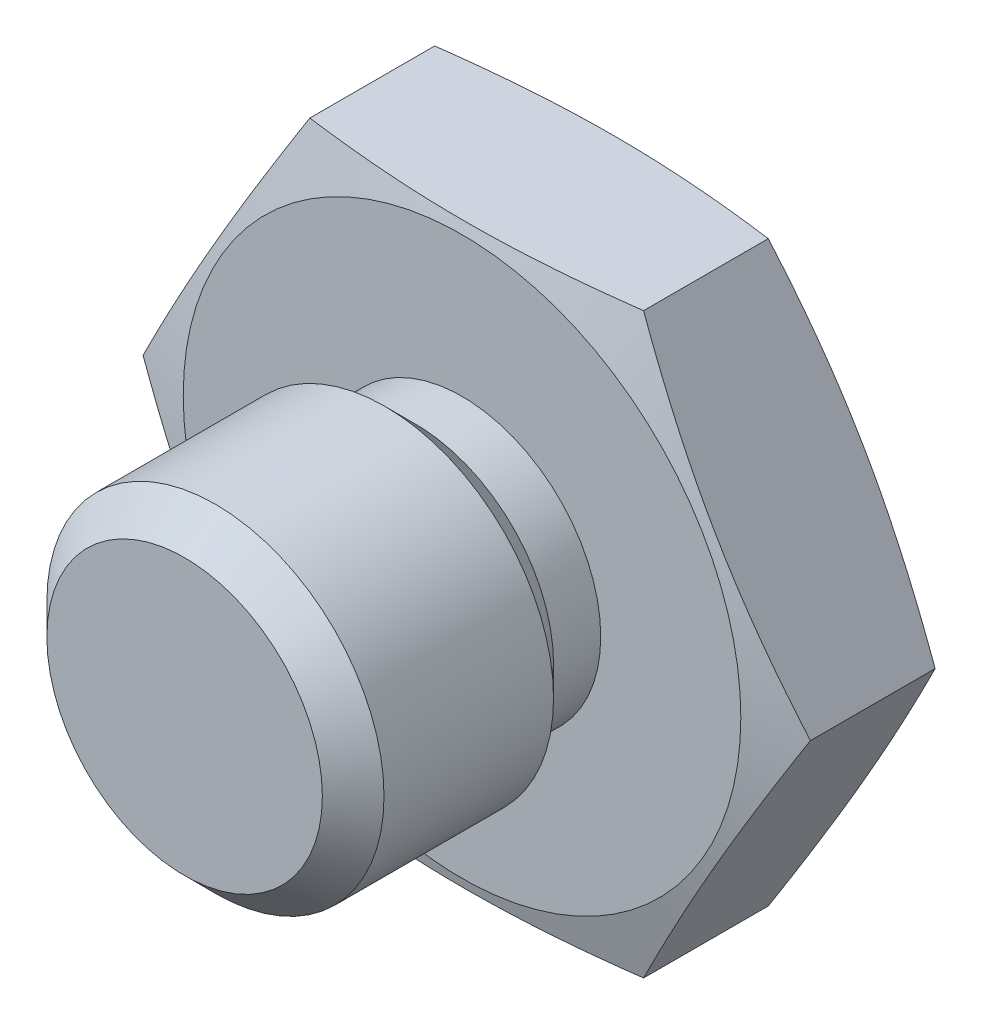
ISO-10303-21;
HEADER;
FILE_DESCRIPTION(('STEP AP214'),'2;1');
FILE_NAME('part.step','',(''),(''),'','','');
FILE_SCHEMA(('AUTOMOTIVE_DESIGN { 1 0 10303 214 1 1 1 1 }'));
ENDSEC;
DATA;
#1=APPLICATION_CONTEXT('core data for automotive mechanical design processes');
#2=APPLICATION_PROTOCOL_DEFINITION('international standard','automotive_design',2000,#1);
#3=PRODUCT_CONTEXT('',#1,'mechanical');
#4=PRODUCT('Part','Part','',(#3));
#5=PRODUCT_RELATED_PRODUCT_CATEGORY('part','',(#4));
#6=PRODUCT_DEFINITION_FORMATION('','',#4);
#7=PRODUCT_DEFINITION_CONTEXT('part definition',#1,'design');
#8=PRODUCT_DEFINITION('design','',#6,#7);
#9=PRODUCT_DEFINITION_SHAPE('','',#8);
#10=(LENGTH_UNIT() NAMED_UNIT(*) SI_UNIT(.MILLI.,.METRE.));
#11=(NAMED_UNIT(*) PLANE_ANGLE_UNIT() SI_UNIT($,.RADIAN.));
#12=(NAMED_UNIT(*) SI_UNIT($,.STERADIAN.) SOLID_ANGLE_UNIT());
#13=UNCERTAINTY_MEASURE_WITH_UNIT(LENGTH_MEASURE(1.E-05),#10,'distance_accuracy_value','');
#14=(GEOMETRIC_REPRESENTATION_CONTEXT(3) GLOBAL_UNCERTAINTY_ASSIGNED_CONTEXT((#13)) GLOBAL_UNIT_ASSIGNED_CONTEXT((#10,
#11,#12)) REPRESENTATION_CONTEXT('',''));
#15=CARTESIAN_POINT('',(0.,0.,0.));
#16=DIRECTION('',(0.,0.,1.));
#17=DIRECTION('',(1.,0.,0.));
#18=AXIS2_PLACEMENT_3D('',#15,#16,#17);
#19=CARTESIAN_POINT('',(0.,0.,9.144));
#20=DIRECTION('',(0.,0.,-1.));
#21=DIRECTION('',(-1.,0.,0.));
#22=AXIS2_PLACEMENT_3D('',#19,#20,#21);
#23=CYLINDRICAL_SURFACE('',#22,5.55625);
#24=CARTESIAN_POINT('',(0.,0.,8.12799999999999));
#25=DIRECTION('',(0.,0.,1.));
#26=DIRECTION('',(1.,0.,0.));
#27=AXIS2_PLACEMENT_3D('',#24,#25,#26);
#28=CIRCLE('',#27,5.55625);
#29=CARTESIAN_POINT('',(5.55625,0.,8.12799999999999));
#30=VERTEX_POINT('',#29);
#31=EDGE_CURVE('E11',#30,#30,#28,.F.);
#32=ORIENTED_EDGE('',*,*,#31,.T.);
#33=EDGE_LOOP('',(#32));
#34=FACE_BOUND('',#33,.T.);
#35=CARTESIAN_POINT('',(0.,0.,2.54));
#36=DIRECTION('',(0.,0.,-1.));
#37=DIRECTION('',(-1.,0.,0.));
#38=AXIS2_PLACEMENT_3D('',#35,#36,#37);
#39=CIRCLE('',#38,5.55625);
#40=CARTESIAN_POINT('',(-5.55625,0.,2.54));
#41=VERTEX_POINT('',#40);
#42=EDGE_CURVE('E225',#41,#41,#39,.T.);
#43=ORIENTED_EDGE('',*,*,#42,.F.);
#44=EDGE_LOOP('',(#43));
#45=FACE_BOUND('',#44,.T.);
#46=ADVANCED_FACE('F38',(#34,#45),#23,.T.);
#47=CARTESIAN_POINT('',(0.,0.,9.144));
#48=DIRECTION('',(0.,0.,1.));
#49=DIRECTION('',(1.,0.,0.));
#50=AXIS2_PLACEMENT_3D('',#47,#48,#49);
#51=PLANE('',#50);
#52=CARTESIAN_POINT('',(0.,0.,9.144));
#53=DIRECTION('',(0.,0.,1.));
#54=DIRECTION('',(1.,0.,0.));
#55=AXIS2_PLACEMENT_3D('',#52,#53,#54);
#56=CIRCLE('',#55,4.54024999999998);
#57=CARTESIAN_POINT('',(4.54024999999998,0.,9.144));
#58=VERTEX_POINT('',#57);
#59=EDGE_CURVE('E45',#58,#58,#56,.T.);
#60=ORIENTED_EDGE('',*,*,#59,.T.);
#61=EDGE_LOOP('',(#60));
#62=FACE_BOUND('',#61,.T.);
#63=ADVANCED_FACE('F183',(#62),#51,.T.);
#64=CARTESIAN_POINT('',(0.,0.,0.));
#65=DIRECTION('',(0.,0.,-1.));
#66=DIRECTION('',(-1.,0.,0.));
#67=AXIS2_PLACEMENT_3D('',#64,#65,#66);
#68=CYLINDRICAL_SURFACE('',#67,4.572);
#69=CARTESIAN_POINT('',(0.,0.,1.55575));
#70=DIRECTION('',(0.,0.,-1.));
#71=DIRECTION('',(-1.,0.,0.));
#72=AXIS2_PLACEMENT_3D('',#69,#70,#71);
#73=CIRCLE('',#72,4.572);
#74=CARTESIAN_POINT('',(-4.572,0.,1.55575));
#75=VERTEX_POINT('',#74);
#76=EDGE_CURVE('E226',#75,#75,#73,.T.);
#77=ORIENTED_EDGE('',*,*,#76,.T.);
#78=EDGE_LOOP('',(#77));
#79=FACE_BOUND('',#78,.T.);
#80=CARTESIAN_POINT('',(0.,0.,0.));
#81=DIRECTION('',(0.,0.,-1.));
#82=DIRECTION('',(-1.,0.,0.));
#83=AXIS2_PLACEMENT_3D('',#80,#81,#82);
#84=CIRCLE('',#83,4.572);
#85=CARTESIAN_POINT('',(-4.572,0.,0.));
#86=VERTEX_POINT('',#85);
#87=EDGE_CURVE('E229',#86,#86,#84,.T.);
#88=ORIENTED_EDGE('',*,*,#87,.F.);
#89=EDGE_LOOP('',(#88));
#90=FACE_BOUND('',#89,.T.);
#91=ADVANCED_FACE('F148',(#79,#90),#68,.T.);
#92=CARTESIAN_POINT('',(0.,0.,1.55575));
#93=DIRECTION('',(0.,0.,1.));
#94=DIRECTION('',(1.,0.,0.));
#95=AXIS2_PLACEMENT_3D('',#92,#93,#94);
#96=CONICAL_SURFACE('',#95,4.572,0.785398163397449);
#97=ORIENTED_EDGE('',*,*,#42,.T.);
#98=EDGE_LOOP('',(#97));
#99=FACE_BOUND('',#98,.T.);
#100=ORIENTED_EDGE('',*,*,#76,.F.);
#101=EDGE_LOOP('',(#100));
#102=FACE_BOUND('',#101,.T.);
#103=ADVANCED_FACE('F207',(#99,#102),#96,.T.);
#104=CARTESIAN_POINT('',(-10.9985226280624,0.,0.));
#105=DIRECTION('',(0.,0.,1.));
#106=DIRECTION('',(1.,0.,0.));
#107=AXIS2_PLACEMENT_3D('',#104,#105,#106);
#108=PLANE('',#107);
#109=CARTESIAN_POINT('',(0.,0.,0.));
#110=DIRECTION('',(0.,0.,-1.));
#111=DIRECTION('',(-1.,0.,0.));
#112=AXIS2_PLACEMENT_3D('',#109,#110,#111);
#113=CIRCLE('',#112,9.18959094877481);
#114=CARTESIAN_POINT('',(-9.18959094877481,0.,0.));
#115=VERTEX_POINT('',#114);
#116=EDGE_CURVE('E135',#115,#115,#113,.T.);
#117=ORIENTED_EDGE('',*,*,#116,.F.);
#118=EDGE_LOOP('',(#117));
#119=FACE_BOUND('',#118,.T.);
#120=ORIENTED_EDGE('',*,*,#87,.T.);
#121=EDGE_LOOP('',(#120));
#122=FACE_BOUND('',#121,.T.);
#123=ADVANCED_FACE('F147',(#119,#122),#108,.T.);
#124=CARTESIAN_POINT('',(0.,0.,-2.54));
#125=DIRECTION('',(0.,0.,-1.));
#126=DIRECTION('',(-1.,0.,0.));
#127=AXIS2_PLACEMENT_3D('',#124,#125,#126);
#128=CONICAL_SURFACE('',#127,18.669,1.30899693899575);
#129=CARTESIAN_POINT('',(-5.49914584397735,-9.5252,-0.484732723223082));
#130=CARTESIAN_POINT('',(-5.7275259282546,-9.12963409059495,-0.423513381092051));
#131=CARTESIAN_POINT('',(-5.95632008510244,-8.73335098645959,-0.367936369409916));
#132=CARTESIAN_POINT('',(-6.41471638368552,-7.93938530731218,-0.270292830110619));
#133=CARTESIAN_POINT('',(-6.64431881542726,-7.54170222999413,-0.228231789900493));
#134=CARTESIAN_POINT('',(-7.10293961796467,-6.74734769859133,-0.160075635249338));
#135=CARTESIAN_POINT('',(-7.33195488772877,-6.35068161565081,-0.133899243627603));
#136=CARTESIAN_POINT('',(-7.7902774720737,-5.55684361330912,-0.098799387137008));
#137=CARTESIAN_POINT('',(-8.01958472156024,-5.15967180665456,-0.0898725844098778));
#138=CARTESIAN_POINT('',(-8.47819922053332,-4.36532819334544,-0.0898725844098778));
#139=CARTESIAN_POINT('',(-8.70750647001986,-3.96815638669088,-0.098799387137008));
#140=CARTESIAN_POINT('',(-9.16582905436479,-3.17431838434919,-0.133899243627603));
#141=CARTESIAN_POINT('',(-9.3948443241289,-2.77765230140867,-0.160075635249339));
#142=CARTESIAN_POINT('',(-9.8534651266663,-1.98329777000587,-0.228231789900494));
#143=CARTESIAN_POINT('',(-10.083067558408,-1.58561469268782,-0.27029283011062));
#144=CARTESIAN_POINT('',(-10.5414638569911,-0.791649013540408,-0.367936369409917));
#145=CARTESIAN_POINT('',(-10.770258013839,-0.395365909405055,-0.423513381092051));
#146=CARTESIAN_POINT('',(-10.9986380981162,0.000200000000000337,-0.484732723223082));
#147=B_SPLINE_CURVE_WITH_KNOTS('',3,(#129,#130,#131,#132,#133,#134,#135,#136,#137,#138,#139,
#140,#141,#142,#143,#144,#145,#146),.UNSPECIFIED.,.F.,.F.,(4,2,2,2,2,2,2,2,4),(0.,
1.38260595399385,2.7657725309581,4.14180081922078,5.51756281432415,6.89332480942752,
8.26935309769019,9.65251967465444,11.0351256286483),.UNSPECIFIED.);
#148=CARTESIAN_POINT('',(-5.49926131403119,-9.525,-0.484701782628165));
#149=VERTEX_POINT('',#148);
#150=CARTESIAN_POINT('',(-10.9985226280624,0.,-0.484701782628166));
#151=VERTEX_POINT('',#150);
#152=EDGE_CURVE('E110',#149,#151,#147,.T.);
#153=ORIENTED_EDGE('',*,*,#152,.F.);
#154=CARTESIAN_POINT('',(-14.6812478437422,-9.525,-2.2268796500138));
#155=CARTESIAN_POINT('',(-14.247613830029,-9.525,-2.12943108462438));
#156=CARTESIAN_POINT('',(-13.8137122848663,-9.525,-2.03315206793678));
#157=CARTESIAN_POINT('',(-12.945242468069,-9.525,-1.84356458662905));
#158=CARTESIAN_POINT('',(-12.5106741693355,-9.525,-1.75025624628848));
#159=CARTESIAN_POINT('',(-11.6403676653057,-9.525,-1.56716404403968));
#160=CARTESIAN_POINT('',(-11.2046287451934,-9.525,-1.47738356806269));
#161=CARTESIAN_POINT('',(-10.3322537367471,-9.525,-1.30229497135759));
#162=CARTESIAN_POINT('',(-9.89561765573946,-9.525,-1.21698681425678));
#163=CARTESIAN_POINT('',(-9.02470452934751,-9.525,-1.05255540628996));
#164=CARTESIAN_POINT('',(-8.59043565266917,-9.525,-0.973389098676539));
#165=CARTESIAN_POINT('',(-7.72070990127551,-9.525,-0.821820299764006));
#166=CARTESIAN_POINT('',(-7.28525302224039,-9.525,-0.749417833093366));
#167=CARTESIAN_POINT('',(-6.41306799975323,-9.525,-0.612982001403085));
#168=CARTESIAN_POINT('',(-5.97634000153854,-9.525,-0.548947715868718));
#169=CARTESIAN_POINT('',(-5.10149008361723,-9.525,-0.43110971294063));
#170=CARTESIAN_POINT('',(-4.66336816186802,-9.525,-0.377306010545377));
#171=CARTESIAN_POINT('',(-3.780738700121,-9.525,-0.281424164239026));
#172=CARTESIAN_POINT('',(-3.33621555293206,-9.525,-0.239487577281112));
#173=CARTESIAN_POINT('',(-2.44602311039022,-9.525,-0.17021398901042));
#174=CARTESIAN_POINT('',(-2.00035384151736,-9.525,-0.14287665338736));
#175=CARTESIAN_POINT('',(-1.10851776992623,-9.525,-0.104394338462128));
#176=CARTESIAN_POINT('',(-0.662351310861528,-9.525,-0.0932415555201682));
#177=CARTESIAN_POINT('',(0.230085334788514,-9.525,-0.0878175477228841));
#178=CARTESIAN_POINT('',(0.676355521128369,-9.525,-0.0935462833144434));
#179=CARTESIAN_POINT('',(1.56996421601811,-9.525,-0.121563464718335));
#180=CARTESIAN_POINT('',(2.01730082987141,-9.525,-0.143911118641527));
#181=CARTESIAN_POINT('',(2.91094001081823,-9.525,-0.203877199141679));
#182=CARTESIAN_POINT('',(3.35724255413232,-9.525,-0.241495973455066));
#183=CARTESIAN_POINT('',(4.24880449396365,-9.525,-0.330071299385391));
#184=CARTESIAN_POINT('',(4.69406298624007,-9.525,-0.381036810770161));
#185=CARTESIAN_POINT('',(5.58314220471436,-9.525,-0.494144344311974));
#186=CARTESIAN_POINT('',(6.026962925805,-9.525,-0.556286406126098));
#187=CARTESIAN_POINT('',(6.884403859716,-9.525,-0.685383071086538));
#188=CARTESIAN_POINT('',(7.29811162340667,-9.525,-0.751762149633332));
#189=CARTESIAN_POINT('',(8.12442684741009,-9.525,-0.891079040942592));
#190=CARTESIAN_POINT('',(8.53703427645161,-9.525,-0.964017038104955));
#191=CARTESIAN_POINT('',(9.36130559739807,-9.525,-1.11524942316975));
#192=CARTESIAN_POINT('',(9.77296938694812,-9.525,-1.19354436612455));
#193=CARTESIAN_POINT('',(10.5954357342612,-9.525,-1.35449853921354));
#194=CARTESIAN_POINT('',(11.0062383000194,-9.525,-1.437157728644));
#195=CARTESIAN_POINT('',(11.8272085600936,-9.525,-1.60606867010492));
#196=CARTESIAN_POINT('',(12.2373760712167,-9.525,-1.69232131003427));
#197=CARTESIAN_POINT('',(13.0570816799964,-9.525,-1.86777160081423));
#198=CARTESIAN_POINT('',(13.4666197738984,-9.525,-1.95696926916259));
#199=CARTESIAN_POINT('',(14.6943745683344,-9.525,-2.22818055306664));
#200=CARTESIAN_POINT('',(15.5117890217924,-9.525,-2.41382438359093));
#201=CARTESIAN_POINT('',(17.1372505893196,-9.525,-2.79004702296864));
#202=CARTESIAN_POINT('',(17.9453126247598,-9.525,-2.98056178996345));
#203=CARTESIAN_POINT('',(19.5603058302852,-9.525,-3.36638339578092));
#204=CARTESIAN_POINT('',(20.3672369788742,-9.525,-3.56169032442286));
#205=CARTESIAN_POINT('',(21.9792065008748,-9.525,-3.95559693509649));
#206=CARTESIAN_POINT('',(22.7842459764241,-9.525,-4.1541921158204));
#207=CARTESIAN_POINT('',(23.9912908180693,-9.525,-4.45409478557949));
#208=CARTESIAN_POINT('',(24.3935467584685,-9.525,-4.55439565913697));
#209=CARTESIAN_POINT('',(25.1979097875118,-9.525,-4.75559072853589));
#210=CARTESIAN_POINT('',(25.6000168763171,-9.525,-4.85648492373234));
#211=CARTESIAN_POINT('',(26.0020590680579,-9.525,-4.95763704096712));
#212=B_SPLINE_CURVE_WITH_KNOTS('',3,(#154,#155,#156,#157,#158,#159,#160,#161,#162,#163,#164,
#165,#166,#167,#168,#169,#170,#171,#172,#173,#174,#175,#176,#177,#178,#179,#180,#181,#182,#183,
#184,#185,#186,#187,#188,#189,#190,#191,#192,#193,#194,#195,#196,#197,#198,#199,#200,#201,#202,
#203,#204,#205,#206,#207,#208,#209,#210,#211),.UNSPECIFIED.,.F.,.F.,(4,2,2,2,2,2,2,2,2,2,2,2,2,
2,2,2,2,2,2,2,2,2,2,2,2,2,2,2,4),(0.,1.33335147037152,2.66675864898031,4.0014157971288,
5.33606208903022,6.66029686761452,7.98453646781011,9.30863027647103,10.6327260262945,
11.9720077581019,13.3112588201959,14.649863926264,15.9884658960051,17.3318598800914,
18.6752844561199,20.0196132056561,21.3639467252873,22.6208819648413,23.8778525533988,
25.1349535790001,26.3920428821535,27.6494446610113,28.9068539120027,31.4214970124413,
33.9121307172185,36.4028111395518,38.8903254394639,40.1340416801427,41.3777565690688),.UNSPECIFIED.);
#213=CARTESIAN_POINT('',(5.49926131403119,-9.525,-0.484701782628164));
#214=VERTEX_POINT('',#213);
#215=EDGE_CURVE('E106',#214,#149,#212,.F.);
#216=ORIENTED_EDGE('',*,*,#215,.F.);
#217=CARTESIAN_POINT('',(10.9986380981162,0.000199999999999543,-0.484732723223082));
#218=CARTESIAN_POINT('',(10.770258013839,-0.395365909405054,-0.423513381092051));
#219=CARTESIAN_POINT('',(10.5414638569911,-0.791649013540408,-0.367936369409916));
#220=CARTESIAN_POINT('',(10.083067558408,-1.58561469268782,-0.270292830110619));
#221=CARTESIAN_POINT('',(9.8534651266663,-1.98329777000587,-0.228231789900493));
#222=CARTESIAN_POINT('',(9.3948443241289,-2.77765230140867,-0.160075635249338));
#223=CARTESIAN_POINT('',(9.16582905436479,-3.1743183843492,-0.133899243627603));
#224=CARTESIAN_POINT('',(8.70750647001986,-3.96815638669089,-0.0987993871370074));
#225=CARTESIAN_POINT('',(8.47819922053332,-4.36532819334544,-0.0898725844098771));
#226=CARTESIAN_POINT('',(8.01958472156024,-5.15967180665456,-0.0898725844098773));
#227=CARTESIAN_POINT('',(7.7902774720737,-5.55684361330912,-0.0987993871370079));
#228=CARTESIAN_POINT('',(7.33195488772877,-6.35068161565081,-0.133899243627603));
#229=CARTESIAN_POINT('',(7.10293961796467,-6.74734769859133,-0.160075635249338));
#230=CARTESIAN_POINT('',(6.64431881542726,-7.54170222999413,-0.228231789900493));
#231=CARTESIAN_POINT('',(6.41471638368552,-7.93938530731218,-0.270292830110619));
#232=CARTESIAN_POINT('',(5.95632008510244,-8.73335098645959,-0.367936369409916));
#233=CARTESIAN_POINT('',(5.72752592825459,-9.12963409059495,-0.423513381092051));
#234=CARTESIAN_POINT('',(5.49914584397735,-9.5252,-0.484732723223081));
#235=B_SPLINE_CURVE_WITH_KNOTS('',3,(#217,#218,#219,#220,#221,#222,#223,#224,#225,#226,#227,
#228,#229,#230,#231,#232,#233,#234),.UNSPECIFIED.,.F.,.F.,(4,2,2,2,2,2,2,2,4),(0.,
1.38260595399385,2.7657725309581,4.14180081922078,5.51756281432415,6.89332480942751,
8.26935309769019,9.65251967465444,11.0351256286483),.UNSPECIFIED.);
#236=CARTESIAN_POINT('',(10.9985226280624,0.,-0.484701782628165));
#237=VERTEX_POINT('',#236);
#238=EDGE_CURVE('E162',#237,#214,#235,.T.);
#239=ORIENTED_EDGE('',*,*,#238,.F.);
#240=CARTESIAN_POINT('',(5.49914584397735,9.5252,-0.484732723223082));
#241=CARTESIAN_POINT('',(5.7275259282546,9.12963409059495,-0.423513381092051));
#242=CARTESIAN_POINT('',(5.95632008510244,8.73335098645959,-0.367936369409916));
#243=CARTESIAN_POINT('',(6.41471638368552,7.93938530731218,-0.270292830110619));
#244=CARTESIAN_POINT('',(6.64431881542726,7.54170222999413,-0.228231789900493));
#245=CARTESIAN_POINT('',(7.10293961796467,6.74734769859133,-0.160075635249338));
#246=CARTESIAN_POINT('',(7.33195488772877,6.35068161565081,-0.133899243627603));
#247=CARTESIAN_POINT('',(7.7902774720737,5.55684361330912,-0.098799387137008));
#248=CARTESIAN_POINT('',(8.01958472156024,5.15967180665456,-0.0898725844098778));
#249=CARTESIAN_POINT('',(8.47819922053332,4.36532819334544,-0.0898725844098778));
#250=CARTESIAN_POINT('',(8.70750647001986,3.96815638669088,-0.098799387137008));
#251=CARTESIAN_POINT('',(9.16582905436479,3.17431838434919,-0.133899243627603));
#252=CARTESIAN_POINT('',(9.3948443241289,2.77765230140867,-0.160075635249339));
#253=CARTESIAN_POINT('',(9.8534651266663,1.98329777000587,-0.228231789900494));
#254=CARTESIAN_POINT('',(10.083067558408,1.58561469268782,-0.27029283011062));
#255=CARTESIAN_POINT('',(10.5414638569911,0.791649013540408,-0.367936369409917));
#256=CARTESIAN_POINT('',(10.770258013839,0.395365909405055,-0.423513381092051));
#257=CARTESIAN_POINT('',(10.9986380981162,-0.000200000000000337,-0.484732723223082));
#258=B_SPLINE_CURVE_WITH_KNOTS('',3,(#240,#241,#242,#243,#244,#245,#246,#247,#248,#249,#250,
#251,#252,#253,#254,#255,#256,#257),.UNSPECIFIED.,.F.,.F.,(4,2,2,2,2,2,2,2,4),(0.,
1.38260595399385,2.7657725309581,4.14180081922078,5.51756281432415,6.89332480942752,
8.26935309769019,9.65251967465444,11.0351256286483),.UNSPECIFIED.);
#259=CARTESIAN_POINT('',(5.49926131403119,9.525,-0.484701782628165));
#260=VERTEX_POINT('',#259);
#261=EDGE_CURVE('E168',#260,#237,#258,.T.);
#262=ORIENTED_EDGE('',*,*,#261,.F.);
#263=CARTESIAN_POINT('',(-14.6812478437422,9.525,-2.2268796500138));
#264=CARTESIAN_POINT('',(-14.247613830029,9.525,-2.12943108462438));
#265=CARTESIAN_POINT('',(-13.8137122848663,9.525,-2.03315206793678));
#266=CARTESIAN_POINT('',(-12.945242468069,9.525,-1.84356458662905));
#267=CARTESIAN_POINT('',(-12.5106741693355,9.525,-1.75025624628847));
#268=CARTESIAN_POINT('',(-11.6403676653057,9.525,-1.56716404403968));
#269=CARTESIAN_POINT('',(-11.2046287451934,9.525,-1.47738356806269));
#270=CARTESIAN_POINT('',(-10.332253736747,9.525,-1.30229497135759));
#271=CARTESIAN_POINT('',(-9.89561765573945,9.525,-1.21698681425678));
#272=CARTESIAN_POINT('',(-9.02470452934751,9.525,-1.05255540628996));
#273=CARTESIAN_POINT('',(-8.59043565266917,9.525,-0.973389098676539));
#274=CARTESIAN_POINT('',(-7.72070990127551,9.525,-0.821820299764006));
#275=CARTESIAN_POINT('',(-7.28525302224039,9.525,-0.749417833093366));
#276=CARTESIAN_POINT('',(-6.41306799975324,9.525,-0.612982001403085));
#277=CARTESIAN_POINT('',(-5.97634000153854,9.525,-0.548947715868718));
#278=CARTESIAN_POINT('',(-5.10149008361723,9.525,-0.43110971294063));
#279=CARTESIAN_POINT('',(-4.66336816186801,9.525,-0.377306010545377));
#280=CARTESIAN_POINT('',(-3.780738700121,9.525,-0.281424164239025));
#281=CARTESIAN_POINT('',(-3.33621555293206,9.525,-0.239487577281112));
#282=CARTESIAN_POINT('',(-2.44602311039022,9.525,-0.17021398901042));
#283=CARTESIAN_POINT('',(-2.00035384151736,9.525,-0.14287665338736));
#284=CARTESIAN_POINT('',(-1.10851776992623,9.525,-0.104394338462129));
#285=CARTESIAN_POINT('',(-0.662351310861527,9.525,-0.0932415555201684));
#286=CARTESIAN_POINT('',(0.230085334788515,9.525,-0.0878175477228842));
#287=CARTESIAN_POINT('',(0.67635552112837,9.525,-0.0935462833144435));
#288=CARTESIAN_POINT('',(1.56996421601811,9.525,-0.121563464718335));
#289=CARTESIAN_POINT('',(2.01730082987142,9.525,-0.143911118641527));
#290=CARTESIAN_POINT('',(2.91094001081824,9.525,-0.203877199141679));
#291=CARTESIAN_POINT('',(3.35724255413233,9.525,-0.241495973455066));
#292=CARTESIAN_POINT('',(4.24880449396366,9.525,-0.330071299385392));
#293=CARTESIAN_POINT('',(4.69406298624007,9.525,-0.381036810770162));
#294=CARTESIAN_POINT('',(5.58314220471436,9.525,-0.494144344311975));
#295=CARTESIAN_POINT('',(6.026962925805,9.525,-0.556286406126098));
#296=CARTESIAN_POINT('',(6.88440385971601,9.525,-0.685383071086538));
#297=CARTESIAN_POINT('',(7.29811162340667,9.525,-0.751762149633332));
#298=CARTESIAN_POINT('',(8.12442684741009,9.525,-0.891079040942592));
#299=CARTESIAN_POINT('',(8.53703427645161,9.525,-0.964017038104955));
#300=CARTESIAN_POINT('',(9.36130559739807,9.525,-1.11524942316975));
#301=CARTESIAN_POINT('',(9.77296938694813,9.525,-1.19354436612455));
#302=CARTESIAN_POINT('',(10.5954357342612,9.525,-1.35449853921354));
#303=CARTESIAN_POINT('',(11.0062383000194,9.525,-1.437157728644));
#304=CARTESIAN_POINT('',(11.8272085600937,9.525,-1.60606867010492));
#305=CARTESIAN_POINT('',(12.2373760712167,9.525,-1.69232131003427));
#306=CARTESIAN_POINT('',(13.0570816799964,9.525,-1.86777160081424));
#307=CARTESIAN_POINT('',(13.4666197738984,9.525,-1.95696926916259));
#308=CARTESIAN_POINT('',(14.6943745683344,9.525,-2.22818055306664));
#309=CARTESIAN_POINT('',(15.5117890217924,9.525,-2.41382438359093));
#310=CARTESIAN_POINT('',(17.1372505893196,9.525,-2.79004702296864));
#311=CARTESIAN_POINT('',(17.9453126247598,9.525,-2.98056178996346));
#312=CARTESIAN_POINT('',(19.5603058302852,9.525,-3.36638339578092));
#313=CARTESIAN_POINT('',(20.3672369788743,9.525,-3.56169032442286));
#314=CARTESIAN_POINT('',(21.9792065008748,9.525,-3.95559693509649));
#315=CARTESIAN_POINT('',(22.7842459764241,9.525,-4.1541921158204));
#316=CARTESIAN_POINT('',(23.9912908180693,9.525,-4.45409478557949));
#317=CARTESIAN_POINT('',(24.3935467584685,9.525,-4.55439565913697));
#318=CARTESIAN_POINT('',(25.1979097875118,9.525,-4.75559072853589));
#319=CARTESIAN_POINT('',(25.6000168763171,9.525,-4.85648492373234));
#320=CARTESIAN_POINT('',(26.0020590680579,9.525,-4.95763704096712));
#321=B_SPLINE_CURVE_WITH_KNOTS('',3,(#263,#264,#265,#266,#267,#268,#269,#270,#271,#272,#273,
#274,#275,#276,#277,#278,#279,#280,#281,#282,#283,#284,#285,#286,#287,#288,#289,#290,#291,#292,
#293,#294,#295,#296,#297,#298,#299,#300,#301,#302,#303,#304,#305,#306,#307,#308,#309,#310,#311,
#312,#313,#314,#315,#316,#317,#318,#319,#320),.UNSPECIFIED.,.F.,.F.,(4,2,2,2,2,2,2,2,2,2,2,2,2,
2,2,2,2,2,2,2,2,2,2,2,2,2,2,2,4),(0.,1.33335147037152,2.66675864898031,4.0014157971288,
5.33606208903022,6.66029686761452,7.9845364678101,9.30863027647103,10.6327260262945,
11.9720077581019,13.3112588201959,14.649863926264,15.9884658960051,17.3318598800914,
18.6752844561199,20.0196132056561,21.3639467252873,22.6208819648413,23.8778525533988,
25.1349535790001,26.3920428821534,27.6494446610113,28.9068539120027,31.4214970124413,
33.9121307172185,36.4028111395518,38.8903254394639,40.1340416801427,41.3777565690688),.UNSPECIFIED.);
#322=CARTESIAN_POINT('',(-5.49926131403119,9.525,-0.484701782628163));
#323=VERTEX_POINT('',#322);
#324=EDGE_CURVE('E115',#260,#323,#321,.F.);
#325=ORIENTED_EDGE('',*,*,#324,.T.);
#326=CARTESIAN_POINT('',(-10.9986380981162,-0.0002,-0.484732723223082));
#327=CARTESIAN_POINT('',(-10.770258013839,0.395365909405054,-0.423513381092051));
#328=CARTESIAN_POINT('',(-10.5414638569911,0.791649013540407,-0.367936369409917));
#329=CARTESIAN_POINT('',(-10.083067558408,1.58561469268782,-0.27029283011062));
#330=CARTESIAN_POINT('',(-9.8534651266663,1.98329777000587,-0.228231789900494));
#331=CARTESIAN_POINT('',(-9.3948443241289,2.77765230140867,-0.160075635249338));
#332=CARTESIAN_POINT('',(-9.16582905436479,3.17431838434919,-0.133899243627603));
#333=CARTESIAN_POINT('',(-8.70750647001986,3.96815638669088,-0.0987993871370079));
#334=CARTESIAN_POINT('',(-8.47819922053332,4.36532819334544,-0.0898725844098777));
#335=CARTESIAN_POINT('',(-8.01958472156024,5.15967180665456,-0.0898725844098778));
#336=CARTESIAN_POINT('',(-7.7902774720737,5.55684361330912,-0.098799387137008));
#337=CARTESIAN_POINT('',(-7.33195488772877,6.35068161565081,-0.133899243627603));
#338=CARTESIAN_POINT('',(-7.10293961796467,6.74734769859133,-0.160075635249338));
#339=CARTESIAN_POINT('',(-6.64431881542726,7.54170222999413,-0.228231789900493));
#340=CARTESIAN_POINT('',(-6.41471638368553,7.93938530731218,-0.270292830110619));
#341=CARTESIAN_POINT('',(-5.95632008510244,8.73335098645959,-0.367936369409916));
#342=CARTESIAN_POINT('',(-5.72752592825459,9.12963409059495,-0.423513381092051));
#343=CARTESIAN_POINT('',(-5.49914584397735,9.5252,-0.484732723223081));
#344=B_SPLINE_CURVE_WITH_KNOTS('',3,(#326,#327,#328,#329,#330,#331,#332,#333,#334,#335,#336,
#337,#338,#339,#340,#341,#342,#343),.UNSPECIFIED.,.F.,.F.,(4,2,2,2,2,2,2,2,4),(0.,
1.38260595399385,2.7657725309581,4.14180081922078,5.51756281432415,6.89332480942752,
8.26935309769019,9.65251967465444,11.0351256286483),.UNSPECIFIED.);
#345=EDGE_CURVE('E52',#151,#323,#344,.T.);
#346=ORIENTED_EDGE('',*,*,#345,.F.);
#347=EDGE_LOOP('',(#153,#216,#239,#262,#325,#346));
#348=FACE_BOUND('',#347,.T.);
#349=ORIENTED_EDGE('',*,*,#116,.T.);
#350=EDGE_LOOP('',(#349));
#351=FACE_BOUND('',#350,.T.);
#352=ADVANCED_FACE('F142',(#348,#351),#128,.T.);
#353=CARTESIAN_POINT('',(-10.9985226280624,0.,-5.08));
#354=DIRECTION('',(-0.866025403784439,-0.5,0.));
#355=DIRECTION('',(0.5,-0.866025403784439,0.));
#356=AXIS2_PLACEMENT_3D('',#353,#354,#355);
#357=PLANE('',#356);
#358=DIRECTION('',(0.,0.,1.));
#359=VECTOR('',#358,1.);
#360=CARTESIAN_POINT('',(-10.9985226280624,0.,-5.08));
#361=LINE('',#360,#359);
#362=CARTESIAN_POINT('',(-10.9985226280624,0.,-4.59529821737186));
#363=VERTEX_POINT('',#362);
#364=EDGE_CURVE('E103',#363,#151,#361,.T.);
#365=ORIENTED_EDGE('',*,*,#364,.F.);
#366=CARTESIAN_POINT('',(-10.9986380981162,0.000200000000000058,-4.59526727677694));
#367=CARTESIAN_POINT('',(-10.770258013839,-0.395365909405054,-4.65648661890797));
#368=CARTESIAN_POINT('',(-10.5414638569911,-0.791649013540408,-4.71206363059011));
#369=CARTESIAN_POINT('',(-10.083067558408,-1.58561469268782,-4.80970716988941));
#370=CARTESIAN_POINT('',(-9.8534651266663,-1.98329777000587,-4.85176821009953));
#371=CARTESIAN_POINT('',(-9.3948443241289,-2.77765230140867,-4.91992436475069));
#372=CARTESIAN_POINT('',(-9.16582905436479,-3.17431838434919,-4.94610075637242));
#373=CARTESIAN_POINT('',(-8.70750647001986,-3.96815638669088,-4.98120061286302));
#374=CARTESIAN_POINT('',(-8.47819922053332,-4.36532819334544,-4.99012741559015));
#375=CARTESIAN_POINT('',(-8.01958472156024,-5.15967180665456,-4.99012741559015));
#376=CARTESIAN_POINT('',(-7.7902774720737,-5.55684361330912,-4.98120061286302));
#377=CARTESIAN_POINT('',(-7.33195488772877,-6.35068161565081,-4.94610075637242));
#378=CARTESIAN_POINT('',(-7.10293961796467,-6.74734769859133,-4.91992436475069));
#379=CARTESIAN_POINT('',(-6.64431881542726,-7.54170222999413,-4.85176821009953));
#380=CARTESIAN_POINT('',(-6.41471638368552,-7.93938530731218,-4.80970716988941));
#381=CARTESIAN_POINT('',(-5.95632008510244,-8.73335098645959,-4.71206363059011));
#382=CARTESIAN_POINT('',(-5.72752592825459,-9.12963409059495,-4.65648661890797));
#383=CARTESIAN_POINT('',(-5.49914584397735,-9.52520000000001,-4.59526727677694));
#384=B_SPLINE_CURVE_WITH_KNOTS('',3,(#366,#367,#368,#369,#370,#371,#372,#373,#374,#375,#376,
#377,#378,#379,#380,#381,#382,#383),.UNSPECIFIED.,.F.,.F.,(4,2,2,2,2,2,2,2,4),(0.,
1.38260595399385,2.7657725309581,4.14180081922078,5.51756281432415,6.89332480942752,
8.26935309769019,9.65251967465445,11.0351256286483),.UNSPECIFIED.);
#385=CARTESIAN_POINT('',(-5.49926131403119,-9.525,-4.59529821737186));
#386=VERTEX_POINT('',#385);
#387=EDGE_CURVE('E87',#363,#386,#384,.T.);
#388=ORIENTED_EDGE('',*,*,#387,.T.);
#389=DIRECTION('',(0.,0.,1.));
#390=VECTOR('',#389,1.);
#391=CARTESIAN_POINT('',(-5.49926131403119,-9.525,-5.08));
#392=LINE('',#391,#390);
#393=EDGE_CURVE('E111',#386,#149,#392,.T.);
#394=ORIENTED_EDGE('',*,*,#393,.T.);
#395=ORIENTED_EDGE('',*,*,#152,.T.);
#396=EDGE_LOOP('',(#365,#388,#394,#395));
#397=FACE_BOUND('',#396,.T.);
#398=ADVANCED_FACE('F109',(#397),#357,.T.);
#399=CARTESIAN_POINT('',(-5.49926131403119,-9.525,-5.08));
#400=DIRECTION('',(0.,-1.,0.));
#401=DIRECTION('',(0.,0.,-1.));
#402=AXIS2_PLACEMENT_3D('',#399,#400,#401);
#403=PLANE('',#402);
#404=ORIENTED_EDGE('',*,*,#393,.F.);
#405=CARTESIAN_POINT('',(-14.6812478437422,-9.525,-2.8531203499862));
#406=CARTESIAN_POINT('',(-14.247613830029,-9.525,-2.95056891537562));
#407=CARTESIAN_POINT('',(-13.8137122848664,-9.525,-3.04684793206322));
#408=CARTESIAN_POINT('',(-12.945242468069,-9.525,-3.23643541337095));
#409=CARTESIAN_POINT('',(-12.5106741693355,-9.525,-3.32974375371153));
#410=CARTESIAN_POINT('',(-11.6403676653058,-9.525,-3.51283595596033));
#411=CARTESIAN_POINT('',(-11.2046287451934,-9.525,-3.60261643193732));
#412=CARTESIAN_POINT('',(-10.3322537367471,-9.525,-3.77770502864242));
#413=CARTESIAN_POINT('',(-9.89561765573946,-9.525,-3.86301318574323));
#414=CARTESIAN_POINT('',(-9.02470452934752,-9.525,-4.02744459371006));
#415=CARTESIAN_POINT('',(-8.59043565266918,-9.525,-4.10661090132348));
#416=CARTESIAN_POINT('',(-7.72070990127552,-9.525,-4.25817970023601));
#417=CARTESIAN_POINT('',(-7.2852530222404,-9.525,-4.33058216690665));
#418=CARTESIAN_POINT('',(-6.41306799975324,-9.525,-4.46701799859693));
#419=CARTESIAN_POINT('',(-5.97634000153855,-9.525,-4.5310522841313));
#420=CARTESIAN_POINT('',(-5.10149008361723,-9.525,-4.64889028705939));
#421=CARTESIAN_POINT('',(-4.66336816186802,-9.525,-4.70269398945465));
#422=CARTESIAN_POINT('',(-3.78073870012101,-9.525,-4.798575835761));
#423=CARTESIAN_POINT('',(-3.33621555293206,-9.525,-4.84051242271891));
#424=CARTESIAN_POINT('',(-2.44602311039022,-9.525,-4.9097860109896));
#425=CARTESIAN_POINT('',(-2.00035384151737,-9.525,-4.93712334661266));
#426=CARTESIAN_POINT('',(-1.10851776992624,-9.525,-4.9756056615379));
#427=CARTESIAN_POINT('',(-0.66235131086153,-9.525,-4.98675844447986));
#428=CARTESIAN_POINT('',(0.230085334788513,-9.525,-4.99218245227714));
#429=CARTESIAN_POINT('',(0.676355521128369,-9.525,-4.98645371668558));
#430=CARTESIAN_POINT('',(1.56996421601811,-9.525,-4.95843653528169));
#431=CARTESIAN_POINT('',(2.01730082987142,-9.525,-4.9360888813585));
#432=CARTESIAN_POINT('',(2.91094001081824,-9.525,-4.87612280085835));
#433=CARTESIAN_POINT('',(3.35724255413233,-9.525,-4.83850402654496));
#434=CARTESIAN_POINT('',(4.24880449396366,-9.525,-4.74992870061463));
#435=CARTESIAN_POINT('',(4.69406298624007,-9.525,-4.69896318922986));
#436=CARTESIAN_POINT('',(5.58314220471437,-9.525,-4.58585565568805));
#437=CARTESIAN_POINT('',(6.026962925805,-9.525,-4.52371359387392));
#438=CARTESIAN_POINT('',(6.88440385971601,-9.525,-4.39461692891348));
#439=CARTESIAN_POINT('',(7.29811162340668,-9.525,-4.32823785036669));
#440=CARTESIAN_POINT('',(8.12442684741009,-9.525,-4.18892095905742));
#441=CARTESIAN_POINT('',(8.53703427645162,-9.525,-4.11598296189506));
#442=CARTESIAN_POINT('',(9.36130559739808,-9.525,-3.96475057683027));
#443=CARTESIAN_POINT('',(9.77296938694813,-9.525,-3.88645563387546));
#444=CARTESIAN_POINT('',(10.5954357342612,-9.525,-3.72550146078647));
#445=CARTESIAN_POINT('',(11.0062383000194,-9.525,-3.64284227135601));
#446=CARTESIAN_POINT('',(11.8272085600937,-9.525,-3.47393132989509));
#447=CARTESIAN_POINT('',(12.2373760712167,-9.525,-3.38767868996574));
#448=CARTESIAN_POINT('',(13.0570816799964,-9.525,-3.21222839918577));
#449=CARTESIAN_POINT('',(13.4666197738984,-9.525,-3.12303073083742));
#450=CARTESIAN_POINT('',(14.6943745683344,-9.525,-2.85181944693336));
#451=CARTESIAN_POINT('',(15.5117890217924,-9.525,-2.66617561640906));
#452=CARTESIAN_POINT('',(17.1372505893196,-9.525,-2.28995297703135));
#453=CARTESIAN_POINT('',(17.9453126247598,-9.525,-2.09943821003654));
#454=CARTESIAN_POINT('',(19.5603058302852,-9.525,-1.71361660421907));
#455=CARTESIAN_POINT('',(20.3672369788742,-9.525,-1.51830967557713));
#456=CARTESIAN_POINT('',(21.9792065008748,-9.525,-1.12440306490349));
#457=CARTESIAN_POINT('',(22.7842459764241,-9.525,-0.925807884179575));
#458=CARTESIAN_POINT('',(23.9912908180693,-9.525,-0.625905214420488));
#459=CARTESIAN_POINT('',(24.3935467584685,-9.525,-0.525604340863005));
#460=CARTESIAN_POINT('',(25.1979097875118,-9.525,-0.324409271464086));
#461=CARTESIAN_POINT('',(25.6000168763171,-9.525,-0.22351507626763));
#462=CARTESIAN_POINT('',(26.0020590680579,-9.525,-0.122362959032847));
#463=B_SPLINE_CURVE_WITH_KNOTS('',3,(#405,#406,#407,#408,#409,#410,#411,#412,#413,#414,#415,
#416,#417,#418,#419,#420,#421,#422,#423,#424,#425,#426,#427,#428,#429,#430,#431,#432,#433,#434,
#435,#436,#437,#438,#439,#440,#441,#442,#443,#444,#445,#446,#447,#448,#449,#450,#451,#452,#453,
#454,#455,#456,#457,#458,#459,#460,#461,#462),.UNSPECIFIED.,.F.,.F.,(4,2,2,2,2,2,2,2,2,2,2,2,2,
2,2,2,2,2,2,2,2,2,2,2,2,2,2,2,4),(0.,1.33335147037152,2.66675864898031,4.00141579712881,
5.33606208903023,6.66029686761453,7.98453646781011,9.30863027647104,10.6327260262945,
11.9720077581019,13.311258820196,14.649863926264,15.9884658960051,17.3318598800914,
18.6752844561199,20.0196132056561,21.3639467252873,22.6208819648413,23.8778525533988,
25.1349535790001,26.3920428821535,27.6494446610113,28.9068539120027,31.4214970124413,
33.9121307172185,36.4028111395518,38.8903254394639,40.1340416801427,41.3777565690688),.UNSPECIFIED.);
#464=CARTESIAN_POINT('',(5.49926131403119,-9.525,-4.59529821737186));
#465=VERTEX_POINT('',#464);
#466=EDGE_CURVE('E60',#386,#465,#463,.T.);
#467=ORIENTED_EDGE('',*,*,#466,.T.);
#468=DIRECTION('',(0.,0.,1.));
#469=VECTOR('',#468,1.);
#470=CARTESIAN_POINT('',(5.49926131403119,-9.525,-5.08));
#471=LINE('',#470,#469);
#472=EDGE_CURVE('E113',#465,#214,#471,.T.);
#473=ORIENTED_EDGE('',*,*,#472,.T.);
#474=ORIENTED_EDGE('',*,*,#215,.T.);
#475=EDGE_LOOP('',(#404,#467,#473,#474));
#476=FACE_BOUND('',#475,.T.);
#477=ADVANCED_FACE('F246',(#476),#403,.T.);
#478=CARTESIAN_POINT('',(5.49926131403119,-9.525,-5.08));
#479=DIRECTION('',(0.866025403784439,-0.5,0.));
#480=DIRECTION('',(0.5,0.866025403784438,0.));
#481=AXIS2_PLACEMENT_3D('',#478,#479,#480);
#482=PLANE('',#481);
#483=ORIENTED_EDGE('',*,*,#472,.F.);
#484=CARTESIAN_POINT('',(5.49914584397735,-9.5252,-4.59526727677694));
#485=CARTESIAN_POINT('',(5.72752592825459,-9.12963409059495,-4.65648661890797));
#486=CARTESIAN_POINT('',(5.95632008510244,-8.73335098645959,-4.71206363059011));
#487=CARTESIAN_POINT('',(6.41471638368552,-7.93938530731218,-4.80970716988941));
#488=CARTESIAN_POINT('',(6.64431881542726,-7.54170222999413,-4.85176821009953));
#489=CARTESIAN_POINT('',(7.10293961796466,-6.74734769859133,-4.91992436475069));
#490=CARTESIAN_POINT('',(7.33195488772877,-6.35068161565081,-4.94610075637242));
#491=CARTESIAN_POINT('',(7.7902774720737,-5.55684361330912,-4.98120061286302));
#492=CARTESIAN_POINT('',(8.01958472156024,-5.15967180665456,-4.99012741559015));
#493=CARTESIAN_POINT('',(8.47819922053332,-4.36532819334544,-4.99012741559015));
#494=CARTESIAN_POINT('',(8.70750647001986,-3.96815638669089,-4.98120061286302));
#495=CARTESIAN_POINT('',(9.16582905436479,-3.1743183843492,-4.94610075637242));
#496=CARTESIAN_POINT('',(9.39484432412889,-2.77765230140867,-4.91992436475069));
#497=CARTESIAN_POINT('',(9.8534651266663,-1.98329777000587,-4.85176821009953));
#498=CARTESIAN_POINT('',(10.083067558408,-1.58561469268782,-4.80970716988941));
#499=CARTESIAN_POINT('',(10.5414638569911,-0.791649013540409,-4.71206363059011));
#500=CARTESIAN_POINT('',(10.770258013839,-0.395365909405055,-4.65648661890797));
#501=CARTESIAN_POINT('',(10.9986380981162,0.00019999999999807,-4.59526727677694));
#502=B_SPLINE_CURVE_WITH_KNOTS('',3,(#484,#485,#486,#487,#488,#489,#490,#491,#492,#493,#494,
#495,#496,#497,#498,#499,#500,#501),.UNSPECIFIED.,.F.,.F.,(4,2,2,2,2,2,2,2,4),(0.,
1.38260595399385,2.7657725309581,4.14180081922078,5.51756281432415,6.89332480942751,
8.26935309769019,9.65251967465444,11.0351256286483),.UNSPECIFIED.);
#503=CARTESIAN_POINT('',(10.9985226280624,0.,-4.59529821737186));
#504=VERTEX_POINT('',#503);
#505=EDGE_CURVE('E242',#465,#504,#502,.T.);
#506=ORIENTED_EDGE('',*,*,#505,.T.);
#507=DIRECTION('',(0.,0.,1.));
#508=VECTOR('',#507,1.);
#509=CARTESIAN_POINT('',(10.9985226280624,0.,-5.08));
#510=LINE('',#509,#508);
#511=EDGE_CURVE('E126',#504,#237,#510,.T.);
#512=ORIENTED_EDGE('',*,*,#511,.T.);
#513=ORIENTED_EDGE('',*,*,#238,.T.);
#514=EDGE_LOOP('',(#483,#506,#512,#513));
#515=FACE_BOUND('',#514,.T.);
#516=ADVANCED_FACE('F249',(#515),#482,.T.);
#517=CARTESIAN_POINT('',(10.9985226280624,0.,-5.08));
#518=DIRECTION('',(0.866025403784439,0.5,0.));
#519=DIRECTION('',(-0.5,0.866025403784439,0.));
#520=AXIS2_PLACEMENT_3D('',#517,#518,#519);
#521=PLANE('',#520);
#522=ORIENTED_EDGE('',*,*,#511,.F.);
#523=CARTESIAN_POINT('',(10.9986380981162,-0.000200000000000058,-4.59526727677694));
#524=CARTESIAN_POINT('',(10.770258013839,0.395365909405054,-4.65648661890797));
#525=CARTESIAN_POINT('',(10.5414638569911,0.791649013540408,-4.71206363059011));
#526=CARTESIAN_POINT('',(10.083067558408,1.58561469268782,-4.80970716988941));
#527=CARTESIAN_POINT('',(9.8534651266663,1.98329777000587,-4.85176821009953));
#528=CARTESIAN_POINT('',(9.3948443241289,2.77765230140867,-4.91992436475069));
#529=CARTESIAN_POINT('',(9.16582905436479,3.17431838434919,-4.94610075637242));
#530=CARTESIAN_POINT('',(8.70750647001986,3.96815638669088,-4.98120061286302));
#531=CARTESIAN_POINT('',(8.47819922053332,4.36532819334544,-4.99012741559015));
#532=CARTESIAN_POINT('',(8.01958472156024,5.15967180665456,-4.99012741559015));
#533=CARTESIAN_POINT('',(7.7902774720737,5.55684361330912,-4.98120061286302));
#534=CARTESIAN_POINT('',(7.33195488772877,6.35068161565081,-4.94610075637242));
#535=CARTESIAN_POINT('',(7.10293961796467,6.74734769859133,-4.91992436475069));
#536=CARTESIAN_POINT('',(6.64431881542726,7.54170222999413,-4.85176821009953));
#537=CARTESIAN_POINT('',(6.41471638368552,7.93938530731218,-4.80970716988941));
#538=CARTESIAN_POINT('',(5.95632008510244,8.73335098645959,-4.71206363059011));
#539=CARTESIAN_POINT('',(5.72752592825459,9.12963409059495,-4.65648661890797));
#540=CARTESIAN_POINT('',(5.49914584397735,9.52520000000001,-4.59526727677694));
#541=B_SPLINE_CURVE_WITH_KNOTS('',3,(#523,#524,#525,#526,#527,#528,#529,#530,#531,#532,#533,
#534,#535,#536,#537,#538,#539,#540),.UNSPECIFIED.,.F.,.F.,(4,2,2,2,2,2,2,2,4),(0.,
1.38260595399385,2.7657725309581,4.14180081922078,5.51756281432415,6.89332480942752,
8.26935309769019,9.65251967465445,11.0351256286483),.UNSPECIFIED.);
#542=CARTESIAN_POINT('',(5.49926131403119,9.525,-4.59529821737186));
#543=VERTEX_POINT('',#542);
#544=EDGE_CURVE('E190',#504,#543,#541,.T.);
#545=ORIENTED_EDGE('',*,*,#544,.T.);
#546=DIRECTION('',(0.,0.,1.));
#547=VECTOR('',#546,1.);
#548=CARTESIAN_POINT('',(5.49926131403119,9.525,-5.08));
#549=LINE('',#548,#547);
#550=EDGE_CURVE('E129',#543,#260,#549,.T.);
#551=ORIENTED_EDGE('',*,*,#550,.T.);
#552=ORIENTED_EDGE('',*,*,#261,.T.);
#553=EDGE_LOOP('',(#522,#545,#551,#552));
#554=FACE_BOUND('',#553,.T.);
#555=ADVANCED_FACE('F180',(#554),#521,.T.);
#556=CARTESIAN_POINT('',(-5.49926131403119,9.525,-5.08));
#557=DIRECTION('',(0.,-1.,0.));
#558=DIRECTION('',(0.,0.,-1.));
#559=AXIS2_PLACEMENT_3D('',#556,#557,#558);
#560=PLANE('',#559);
#561=CARTESIAN_POINT('',(-14.6812478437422,9.525,-2.8531203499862));
#562=CARTESIAN_POINT('',(-14.247613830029,9.525,-2.95056891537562));
#563=CARTESIAN_POINT('',(-13.8137122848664,9.525,-3.04684793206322));
#564=CARTESIAN_POINT('',(-12.945242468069,9.525,-3.23643541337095));
#565=CARTESIAN_POINT('',(-12.5106741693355,9.525,-3.32974375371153));
#566=CARTESIAN_POINT('',(-11.6403676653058,9.525,-3.51283595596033));
#567=CARTESIAN_POINT('',(-11.2046287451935,9.525,-3.60261643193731));
#568=CARTESIAN_POINT('',(-10.3322537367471,9.525,-3.77770502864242));
#569=CARTESIAN_POINT('',(-9.89561765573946,9.525,-3.86301318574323));
#570=CARTESIAN_POINT('',(-9.02470452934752,9.525,-4.02744459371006));
#571=CARTESIAN_POINT('',(-8.59043565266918,9.525,-4.10661090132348));
#572=CARTESIAN_POINT('',(-7.72070990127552,9.525,-4.25817970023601));
#573=CARTESIAN_POINT('',(-7.2852530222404,9.525,-4.33058216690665));
#574=CARTESIAN_POINT('',(-6.41306799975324,9.525,-4.46701799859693));
#575=CARTESIAN_POINT('',(-5.97634000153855,9.525,-4.5310522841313));
#576=CARTESIAN_POINT('',(-5.10149008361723,9.525,-4.64889028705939));
#577=CARTESIAN_POINT('',(-4.66336816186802,9.525,-4.70269398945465));
#578=CARTESIAN_POINT('',(-3.78073870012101,9.525,-4.798575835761));
#579=CARTESIAN_POINT('',(-3.33621555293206,9.525,-4.84051242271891));
#580=CARTESIAN_POINT('',(-2.44602311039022,9.525,-4.90978601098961));
#581=CARTESIAN_POINT('',(-2.00035384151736,9.525,-4.93712334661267));
#582=CARTESIAN_POINT('',(-1.10851776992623,9.525,-4.9756056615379));
#583=CARTESIAN_POINT('',(-0.662351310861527,9.525,-4.98675844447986));
#584=CARTESIAN_POINT('',(0.230085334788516,9.525,-4.99218245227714));
#585=CARTESIAN_POINT('',(0.676355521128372,9.525,-4.98645371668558));
#586=CARTESIAN_POINT('',(1.56996421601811,9.525,-4.95843653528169));
#587=CARTESIAN_POINT('',(2.01730082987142,9.525,-4.9360888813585));
#588=CARTESIAN_POINT('',(2.91094001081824,9.525,-4.87612280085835));
#589=CARTESIAN_POINT('',(3.35724255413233,9.525,-4.83850402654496));
#590=CARTESIAN_POINT('',(4.24880449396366,9.525,-4.74992870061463));
#591=CARTESIAN_POINT('',(4.69406298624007,9.525,-4.69896318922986));
#592=CARTESIAN_POINT('',(5.58314220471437,9.525,-4.58585565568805));
#593=CARTESIAN_POINT('',(6.02696292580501,9.525,-4.52371359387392));
#594=CARTESIAN_POINT('',(6.88440385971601,9.525,-4.39461692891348));
#595=CARTESIAN_POINT('',(7.29811162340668,9.525,-4.32823785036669));
#596=CARTESIAN_POINT('',(8.12442684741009,9.525,-4.18892095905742));
#597=CARTESIAN_POINT('',(8.53703427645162,9.525,-4.11598296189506));
#598=CARTESIAN_POINT('',(9.36130559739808,9.525,-3.96475057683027));
#599=CARTESIAN_POINT('',(9.77296938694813,9.525,-3.88645563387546));
#600=CARTESIAN_POINT('',(10.5954357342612,9.525,-3.72550146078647));
#601=CARTESIAN_POINT('',(11.0062383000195,9.525,-3.64284227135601));
#602=CARTESIAN_POINT('',(11.8272085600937,9.525,-3.47393132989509));
#603=CARTESIAN_POINT('',(12.2373760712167,9.525,-3.38767868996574));
#604=CARTESIAN_POINT('',(13.0570816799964,9.525,-3.21222839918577));
#605=CARTESIAN_POINT('',(13.4666197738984,9.525,-3.12303073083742));
#606=CARTESIAN_POINT('',(14.6943745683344,9.525,-2.85181944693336));
#607=CARTESIAN_POINT('',(15.5117890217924,9.525,-2.66617561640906));
#608=CARTESIAN_POINT('',(17.1372505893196,9.525,-2.28995297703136));
#609=CARTESIAN_POINT('',(17.9453126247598,9.525,-2.09943821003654));
#610=CARTESIAN_POINT('',(19.5603058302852,9.525,-1.71361660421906));
#611=CARTESIAN_POINT('',(20.3672369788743,9.525,-1.51830967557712));
#612=CARTESIAN_POINT('',(21.9792065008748,9.525,-1.12440306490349));
#613=CARTESIAN_POINT('',(22.7842459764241,9.525,-0.925807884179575));
#614=CARTESIAN_POINT('',(23.9912908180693,9.525,-0.625905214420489));
#615=CARTESIAN_POINT('',(24.3935467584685,9.525,-0.525604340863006));
#616=CARTESIAN_POINT('',(25.1979097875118,9.525,-0.324409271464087));
#617=CARTESIAN_POINT('',(25.6000168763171,9.525,-0.22351507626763));
#618=CARTESIAN_POINT('',(26.0020590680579,9.525,-0.122362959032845));
#619=B_SPLINE_CURVE_WITH_KNOTS('',3,(#561,#562,#563,#564,#565,#566,#567,#568,#569,#570,#571,
#572,#573,#574,#575,#576,#577,#578,#579,#580,#581,#582,#583,#584,#585,#586,#587,#588,#589,#590,
#591,#592,#593,#594,#595,#596,#597,#598,#599,#600,#601,#602,#603,#604,#605,#606,#607,#608,#609,
#610,#611,#612,#613,#614,#615,#616,#617,#618),.UNSPECIFIED.,.F.,.F.,(4,2,2,2,2,2,2,2,2,2,2,2,2,
2,2,2,2,2,2,2,2,2,2,2,2,2,2,2,4),(0.,1.33335147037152,2.66675864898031,4.00141579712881,
5.33606208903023,6.66029686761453,7.98453646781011,9.30863027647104,10.6327260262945,
11.972007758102,13.311258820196,14.649863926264,15.9884658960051,17.3318598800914,
18.6752844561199,20.0196132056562,21.3639467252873,22.6208819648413,23.8778525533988,
25.1349535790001,26.3920428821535,27.6494446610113,28.9068539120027,31.4214970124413,
33.9121307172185,36.4028111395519,38.8903254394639,40.1340416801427,41.3777565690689),.UNSPECIFIED.);
#620=CARTESIAN_POINT('',(-5.49926131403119,9.525,-4.59529821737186));
#621=VERTEX_POINT('',#620);
#622=EDGE_CURVE('E107',#621,#543,#619,.T.);
#623=ORIENTED_EDGE('',*,*,#622,.F.);
#624=DIRECTION('',(0.,0.,1.));
#625=VECTOR('',#624,1.);
#626=CARTESIAN_POINT('',(-5.49926131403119,9.525,-5.08));
#627=LINE('',#626,#625);
#628=EDGE_CURVE('E105',#621,#323,#627,.T.);
#629=ORIENTED_EDGE('',*,*,#628,.T.);
#630=ORIENTED_EDGE('',*,*,#324,.F.);
#631=ORIENTED_EDGE('',*,*,#550,.F.);
#632=EDGE_LOOP('',(#623,#629,#630,#631));
#633=FACE_BOUND('',#632,.T.);
#634=ADVANCED_FACE('F177',(#633),#560,.F.);
#635=CARTESIAN_POINT('',(-5.49926131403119,9.525,-5.08));
#636=DIRECTION('',(-0.866025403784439,0.5,0.));
#637=DIRECTION('',(-0.5,-0.866025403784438,0.));
#638=AXIS2_PLACEMENT_3D('',#635,#636,#637);
#639=PLANE('',#638);
#640=ORIENTED_EDGE('',*,*,#628,.F.);
#641=CARTESIAN_POINT('',(-5.49914584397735,9.5252,-4.59526727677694));
#642=CARTESIAN_POINT('',(-5.72752592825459,9.12963409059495,-4.65648661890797));
#643=CARTESIAN_POINT('',(-5.95632008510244,8.73335098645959,-4.71206363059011));
#644=CARTESIAN_POINT('',(-6.41471638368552,7.93938530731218,-4.80970716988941));
#645=CARTESIAN_POINT('',(-6.64431881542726,7.54170222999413,-4.85176821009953));
#646=CARTESIAN_POINT('',(-7.10293961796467,6.74734769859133,-4.91992436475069));
#647=CARTESIAN_POINT('',(-7.33195488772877,6.35068161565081,-4.94610075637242));
#648=CARTESIAN_POINT('',(-7.7902774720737,5.55684361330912,-4.98120061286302));
#649=CARTESIAN_POINT('',(-8.01958472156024,5.15967180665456,-4.99012741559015));
#650=CARTESIAN_POINT('',(-8.47819922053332,4.36532819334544,-4.99012741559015));
#651=CARTESIAN_POINT('',(-8.70750647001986,3.96815638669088,-4.98120061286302));
#652=CARTESIAN_POINT('',(-9.16582905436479,3.17431838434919,-4.94610075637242));
#653=CARTESIAN_POINT('',(-9.3948443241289,2.77765230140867,-4.91992436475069));
#654=CARTESIAN_POINT('',(-9.8534651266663,1.98329777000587,-4.85176821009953));
#655=CARTESIAN_POINT('',(-10.083067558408,1.58561469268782,-4.80970716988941));
#656=CARTESIAN_POINT('',(-10.5414638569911,0.791649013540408,-4.71206363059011));
#657=CARTESIAN_POINT('',(-10.770258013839,0.395365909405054,-4.65648661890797));
#658=CARTESIAN_POINT('',(-10.9986380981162,-0.000200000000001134,-4.59526727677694));
#659=B_SPLINE_CURVE_WITH_KNOTS('',3,(#641,#642,#643,#644,#645,#646,#647,#648,#649,#650,#651,
#652,#653,#654,#655,#656,#657,#658),.UNSPECIFIED.,.F.,.F.,(4,2,2,2,2,2,2,2,4),(0.,
1.38260595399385,2.7657725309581,4.14180081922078,5.51756281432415,6.89332480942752,
8.26935309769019,9.65251967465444,11.0351256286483),.UNSPECIFIED.);
#660=EDGE_CURVE('E91',#621,#363,#659,.T.);
#661=ORIENTED_EDGE('',*,*,#660,.T.);
#662=ORIENTED_EDGE('',*,*,#364,.T.);
#663=ORIENTED_EDGE('',*,*,#345,.T.);
#664=EDGE_LOOP('',(#640,#661,#662,#663));
#665=FACE_BOUND('',#664,.T.);
#666=ADVANCED_FACE('F102',(#665),#639,.T.);
#667=CARTESIAN_POINT('',(0.,0.,-7.54234347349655));
#668=DIRECTION('',(0.,0.,1.));
#669=DIRECTION('',(1.,0.,0.));
#670=AXIS2_PLACEMENT_3D('',#667,#668,#669);
#671=CONICAL_SURFACE('',#670,0.,1.30899693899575);
#672=ORIENTED_EDGE('',*,*,#622,.T.);
#673=ORIENTED_EDGE('',*,*,#544,.F.);
#674=ORIENTED_EDGE('',*,*,#505,.F.);
#675=ORIENTED_EDGE('',*,*,#466,.F.);
#676=ORIENTED_EDGE('',*,*,#387,.F.);
#677=ORIENTED_EDGE('',*,*,#660,.F.);
#678=EDGE_LOOP('',(#672,#673,#674,#675,#676,#677));
#679=FACE_BOUND('',#678,.T.);
#680=CARTESIAN_POINT('',(0.,0.,-5.08));
#681=DIRECTION('',(0.,0.,1.));
#682=DIRECTION('',(1.,0.,0.));
#683=AXIS2_PLACEMENT_3D('',#680,#681,#682);
#684=CIRCLE('',#683,9.18959094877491);
#685=CARTESIAN_POINT('',(9.18959094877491,0.,-5.08));
#686=VERTEX_POINT('',#685);
#687=EDGE_CURVE('E97',#686,#686,#684,.T.);
#688=ORIENTED_EDGE('',*,*,#687,.T.);
#689=EDGE_LOOP('',(#688));
#690=FACE_BOUND('',#689,.T.);
#691=ADVANCED_FACE('F89',(#679,#690),#671,.T.);
#692=CARTESIAN_POINT('',(-10.9985226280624,0.,-5.08));
#693=DIRECTION('',(0.,0.,1.));
#694=DIRECTION('',(1.,0.,0.));
#695=AXIS2_PLACEMENT_3D('',#692,#693,#694);
#696=PLANE('',#695);
#697=ORIENTED_EDGE('',*,*,#687,.F.);
#698=EDGE_LOOP('',(#697));
#699=FACE_BOUND('',#698,.T.);
#700=ADVANCED_FACE('F201',(#699),#696,.F.);
#701=CARTESIAN_POINT('',(0.,0.,9.144));
#702=DIRECTION('',(0.,0.,-1.));
#703=DIRECTION('',(-1.,0.,0.));
#704=AXIS2_PLACEMENT_3D('',#701,#702,#703);
#705=CONICAL_SURFACE('',#704,4.54024999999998,0.785398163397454);
#706=ORIENTED_EDGE('',*,*,#31,.F.);
#707=EDGE_LOOP('',(#706));
#708=FACE_BOUND('',#707,.T.);
#709=ORIENTED_EDGE('',*,*,#59,.F.);
#710=EDGE_LOOP('',(#709));
#711=FACE_BOUND('',#710,.T.);
#712=ADVANCED_FACE('F204',(#708,#711),#705,.T.);
#713=CLOSED_SHELL('',(#46,#63,#91,#103,#123,#352,#398,#477,#516,#555,#634,#666,#691,#700,#712));
#714=MANIFOLD_SOLID_BREP('B2',#713);
#715=ADVANCED_BREP_SHAPE_REPRESENTATION('',(#18,#714),#14);
#716=SHAPE_DEFINITION_REPRESENTATION(#9,#715);
ENDSEC;
END-ISO-10303-21;
